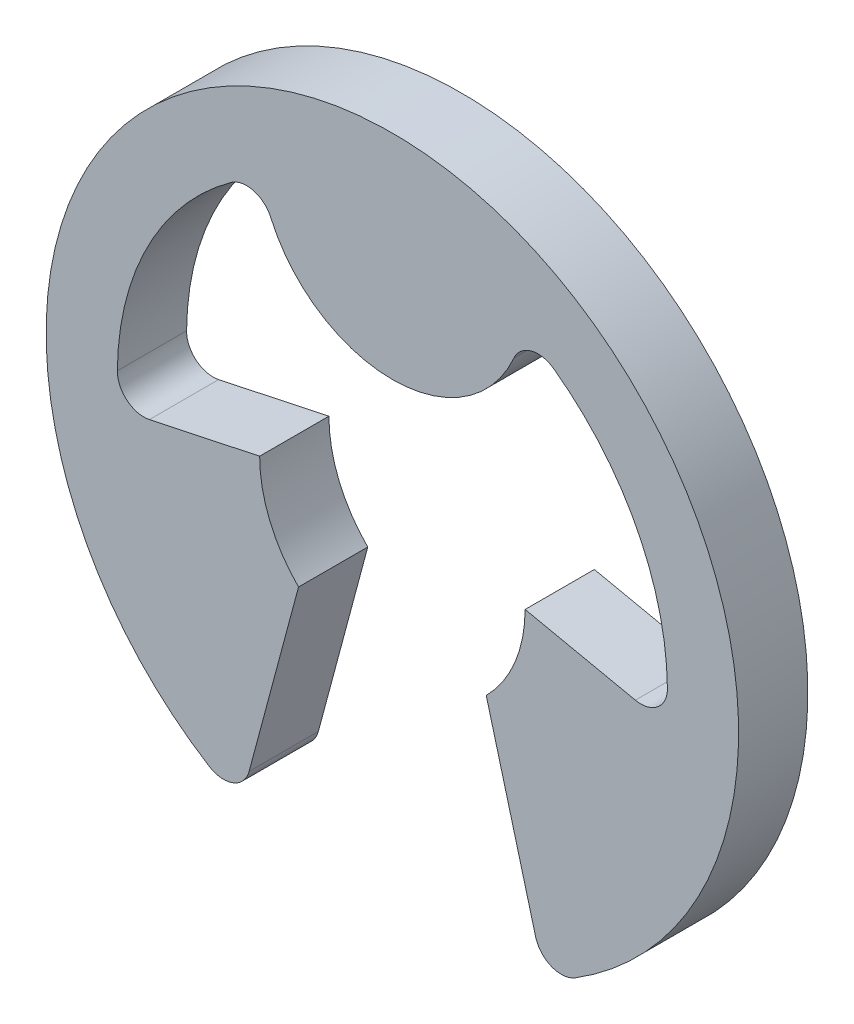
ISO-10303-21;
HEADER;
FILE_DESCRIPTION(('STEP AP214'),'2;1');
FILE_NAME('part.step','',(''),(''),'','','');
FILE_SCHEMA(('AUTOMOTIVE_DESIGN { 1 0 10303 214 1 1 1 1 }'));
ENDSEC;
DATA;
#1=APPLICATION_CONTEXT('core data for automotive mechanical design processes');
#2=APPLICATION_PROTOCOL_DEFINITION('international standard','automotive_design',2000,#1);
#3=PRODUCT_CONTEXT('',#1,'mechanical');
#4=PRODUCT('Part','Part','',(#3));
#5=PRODUCT_RELATED_PRODUCT_CATEGORY('part','',(#4));
#6=PRODUCT_DEFINITION_FORMATION('','',#4);
#7=PRODUCT_DEFINITION_CONTEXT('part definition',#1,'design');
#8=PRODUCT_DEFINITION('design','',#6,#7);
#9=PRODUCT_DEFINITION_SHAPE('','',#8);
#10=(LENGTH_UNIT() NAMED_UNIT(*) SI_UNIT(.MILLI.,.METRE.));
#11=(NAMED_UNIT(*) PLANE_ANGLE_UNIT() SI_UNIT($,.RADIAN.));
#12=(NAMED_UNIT(*) SI_UNIT($,.STERADIAN.) SOLID_ANGLE_UNIT());
#13=UNCERTAINTY_MEASURE_WITH_UNIT(LENGTH_MEASURE(1.E-05),#10,'distance_accuracy_value','');
#14=(GEOMETRIC_REPRESENTATION_CONTEXT(3) GLOBAL_UNCERTAINTY_ASSIGNED_CONTEXT((#13)) GLOBAL_UNIT_ASSIGNED_CONTEXT((#10,
#11,#12)) REPRESENTATION_CONTEXT('',''));
#15=CARTESIAN_POINT('',(0.,0.,0.));
#16=DIRECTION('',(0.,0.,1.));
#17=DIRECTION('',(1.,0.,0.));
#18=AXIS2_PLACEMENT_3D('',#15,#16,#17);
#19=CARTESIAN_POINT('',(0.,2.3,0.6));
#20=DIRECTION('',(0.,0.,-1.));
#21=DIRECTION('',(-1.,0.,0.));
#22=AXIS2_PLACEMENT_3D('',#19,#20,#21);
#23=CYLINDRICAL_SURFACE('',#22,1.15);
#24=CARTESIAN_POINT('',(0.,2.3,0.));
#25=DIRECTION('',(0.,0.,1.));
#26=DIRECTION('',(1.,0.,0.));
#27=AXIS2_PLACEMENT_3D('',#24,#25,#26);
#28=CIRCLE('',#27,1.15);
#29=CARTESIAN_POINT('',(-1.05253488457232,1.83667471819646,0.));
#30=VERTEX_POINT('',#29);
#31=CARTESIAN_POINT('',(1.05253488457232,1.83667471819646,0.));
#32=VERTEX_POINT('',#31);
#33=EDGE_CURVE('E177',#30,#32,#28,.T.);
#34=ORIENTED_EDGE('',*,*,#33,.T.);
#35=DIRECTION('',(0.,0.,-1.));
#36=VECTOR('',#35,1.);
#37=CARTESIAN_POINT('',(1.05253488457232,1.83667471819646,0.6));
#38=LINE('',#37,#36);
#39=CARTESIAN_POINT('',(1.05253488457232,1.83667471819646,0.6));
#40=VERTEX_POINT('',#39);
#41=EDGE_CURVE('E11',#40,#32,#38,.T.);
#42=ORIENTED_EDGE('',*,*,#41,.F.);
#43=CARTESIAN_POINT('',(0.,2.3,0.6));
#44=DIRECTION('',(0.,0.,1.));
#45=DIRECTION('',(1.,0.,0.));
#46=AXIS2_PLACEMENT_3D('',#43,#44,#45);
#47=CIRCLE('',#46,1.15);
#48=CARTESIAN_POINT('',(-1.05253488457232,1.83667471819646,0.6));
#49=VERTEX_POINT('',#48);
#50=EDGE_CURVE('E207',#49,#40,#47,.T.);
#51=ORIENTED_EDGE('',*,*,#50,.F.);
#52=DIRECTION('',(0.,0.,-1.));
#53=VECTOR('',#52,1.);
#54=CARTESIAN_POINT('',(-1.05253488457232,1.83667471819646,0.6));
#55=LINE('',#54,#53);
#56=EDGE_CURVE('E173',#49,#30,#55,.T.);
#57=ORIENTED_EDGE('',*,*,#56,.T.);
#58=EDGE_LOOP('',(#34,#42,#51,#57));
#59=FACE_BOUND('',#58,.T.);
#60=ADVANCED_FACE('F33',(#59),#23,.T.);
#61=CARTESIAN_POINT('',(1.26304186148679,1.74400966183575,0.6));
#62=DIRECTION('',(0.,0.,-1.));
#63=DIRECTION('',(-1.,0.,0.));
#64=AXIS2_PLACEMENT_3D('',#61,#62,#63);
#65=CYLINDRICAL_SURFACE('',#64,0.229999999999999);
#66=CARTESIAN_POINT('',(1.26304186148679,1.74400966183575,0.));
#67=DIRECTION('',(0.,0.,-1.));
#68=DIRECTION('',(-1.,0.,0.));
#69=AXIS2_PLACEMENT_3D('',#66,#67,#68);
#70=CIRCLE('',#69,0.229999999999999);
#71=CARTESIAN_POINT('',(1.39794880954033,1.93028933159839,0.));
#72=VERTEX_POINT('',#71);
#73=EDGE_CURVE('E180',#32,#72,#70,.T.);
#74=ORIENTED_EDGE('',*,*,#73,.T.);
#75=DIRECTION('',(0.,0.,-1.));
#76=VECTOR('',#75,1.);
#77=CARTESIAN_POINT('',(1.39794880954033,1.93028933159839,0.6));
#78=LINE('',#77,#76);
#79=CARTESIAN_POINT('',(1.39794880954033,1.93028933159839,0.6));
#80=VERTEX_POINT('',#79);
#81=EDGE_CURVE('E41',#80,#72,#78,.T.);
#82=ORIENTED_EDGE('',*,*,#81,.F.);
#83=CARTESIAN_POINT('',(1.26304186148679,1.74400966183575,0.6));
#84=DIRECTION('',(0.,0.,-1.));
#85=DIRECTION('',(-1.,0.,0.));
#86=AXIS2_PLACEMENT_3D('',#83,#84,#85);
#87=CIRCLE('',#86,0.229999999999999);
#88=EDGE_CURVE('E116',#40,#80,#87,.T.);
#89=ORIENTED_EDGE('',*,*,#88,.F.);
#90=ORIENTED_EDGE('',*,*,#41,.T.);
#91=EDGE_LOOP('',(#74,#82,#89,#90));
#92=FACE_BOUND('',#91,.T.);
#93=ADVANCED_FACE('F305',(#92),#65,.F.);
#94=CARTESIAN_POINT('',(0.,0.,0.6));
#95=DIRECTION('',(0.,0.,-1.));
#96=DIRECTION('',(-1.,0.,0.));
#97=AXIS2_PLACEMENT_3D('',#94,#95,#96);
#98=CYLINDRICAL_SURFACE('',#97,2.38333333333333);
#99=CARTESIAN_POINT('',(0.,0.,0.));
#100=DIRECTION('',(0.,0.,-1.));
#101=DIRECTION('',(-1.,0.,0.));
#102=AXIS2_PLACEMENT_3D('',#99,#100,#101);
#103=CIRCLE('',#102,2.38333333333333);
#104=CARTESIAN_POINT('',(2.38321010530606,0.0242357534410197,0.));
#105=VERTEX_POINT('',#104);
#106=EDGE_CURVE('E182',#72,#105,#103,.T.);
#107=ORIENTED_EDGE('',*,*,#106,.T.);
#108=DIRECTION('',(0.,0.,-1.));
#109=VECTOR('',#108,1.);
#110=CARTESIAN_POINT('',(2.38321010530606,0.0242357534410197,0.6));
#111=LINE('',#110,#109);
#112=CARTESIAN_POINT('',(2.38321010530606,0.0242357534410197,0.6));
#113=VERTEX_POINT('',#112);
#114=EDGE_CURVE('E238',#113,#105,#111,.T.);
#115=ORIENTED_EDGE('',*,*,#114,.F.);
#116=CARTESIAN_POINT('',(0.,0.,0.6));
#117=DIRECTION('',(0.,0.,-1.));
#118=DIRECTION('',(-1.,0.,0.));
#119=AXIS2_PLACEMENT_3D('',#116,#117,#118);
#120=CIRCLE('',#119,2.38333333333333);
#121=EDGE_CURVE('E246',#80,#113,#120,.T.);
#122=ORIENTED_EDGE('',*,*,#121,.F.);
#123=ORIENTED_EDGE('',*,*,#81,.T.);
#124=EDGE_LOOP('',(#107,#115,#122,#123));
#125=FACE_BOUND('',#124,.T.);
#126=ADVANCED_FACE('F244',(#125),#98,.F.);
#127=CARTESIAN_POINT('',(2.15322199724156,0.0218969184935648,0.6));
#128=DIRECTION('',(0.,0.,-1.));
#129=DIRECTION('',(-1.,0.,0.));
#130=AXIS2_PLACEMENT_3D('',#127,#128,#129);
#131=CYLINDRICAL_SURFACE('',#130,0.229999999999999);
#132=CARTESIAN_POINT('',(2.15322199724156,0.0218969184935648,0.));
#133=DIRECTION('',(0.,0.,-1.));
#134=DIRECTION('',(-1.,0.,0.));
#135=AXIS2_PLACEMENT_3D('',#132,#133,#134);
#136=CIRCLE('',#135,0.229999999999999);
#137=CARTESIAN_POINT('',(2.10540230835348,-0.20307702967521,0.));
#138=VERTEX_POINT('',#137);
#139=EDGE_CURVE('E184',#105,#138,#136,.T.);
#140=ORIENTED_EDGE('',*,*,#139,.T.);
#141=DIRECTION('',(0.,0.,-1.));
#142=VECTOR('',#141,1.);
#143=CARTESIAN_POINT('',(2.10540230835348,-0.20307702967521,0.6));
#144=LINE('',#143,#142);
#145=CARTESIAN_POINT('',(2.10540230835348,-0.20307702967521,0.6));
#146=VERTEX_POINT('',#145);
#147=EDGE_CURVE('E235',#146,#138,#144,.T.);
#148=ORIENTED_EDGE('',*,*,#147,.F.);
#149=CARTESIAN_POINT('',(2.15322199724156,0.0218969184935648,0.6));
#150=DIRECTION('',(0.,0.,-1.));
#151=DIRECTION('',(-1.,0.,0.));
#152=AXIS2_PLACEMENT_3D('',#149,#150,#151);
#153=CIRCLE('',#152,0.229999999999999);
#154=EDGE_CURVE('E264',#113,#146,#153,.T.);
#155=ORIENTED_EDGE('',*,*,#154,.F.);
#156=ORIENTED_EDGE('',*,*,#114,.T.);
#157=EDGE_LOOP('',(#140,#148,#155,#156));
#158=FACE_BOUND('',#157,.T.);
#159=ADVANCED_FACE('F255',(#158),#131,.F.);
#160=CARTESIAN_POINT('',(2.10540230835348,-0.203077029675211,0.6));
#161=DIRECTION('',(-0.207911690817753,-0.978147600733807,0.));
#162=DIRECTION('',(0.978147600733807,-0.207911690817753,0.));
#163=AXIS2_PLACEMENT_3D('',#160,#161,#162);
#164=PLANE('',#163);
#165=DIRECTION('',(-0.978147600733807,0.207911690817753,0.));
#166=VECTOR('',#165,1.);
#167=CARTESIAN_POINT('',(2.10540230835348,-0.203077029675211,0.));
#168=LINE('',#167,#166);
#169=CARTESIAN_POINT('',(1.15,0.,0.));
#170=VERTEX_POINT('',#169);
#171=EDGE_CURVE('E186',#138,#170,#168,.T.);
#172=ORIENTED_EDGE('',*,*,#171,.T.);
#173=DIRECTION('',(0.,0.,-1.));
#174=VECTOR('',#173,1.);
#175=CARTESIAN_POINT('',(1.15,0.,0.6));
#176=LINE('',#175,#174);
#177=CARTESIAN_POINT('',(1.15,0.,0.6));
#178=VERTEX_POINT('',#177);
#179=EDGE_CURVE('E232',#178,#170,#176,.T.);
#180=ORIENTED_EDGE('',*,*,#179,.F.);
#181=DIRECTION('',(-0.978147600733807,0.207911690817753,0.));
#182=VECTOR('',#181,1.);
#183=CARTESIAN_POINT('',(2.10540230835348,-0.203077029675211,0.6));
#184=LINE('',#183,#182);
#185=EDGE_CURVE('E261',#146,#178,#184,.T.);
#186=ORIENTED_EDGE('',*,*,#185,.F.);
#187=ORIENTED_EDGE('',*,*,#147,.T.);
#188=EDGE_LOOP('',(#172,#180,#186,#187));
#189=FACE_BOUND('',#188,.T.);
#190=ADVANCED_FACE('F259',(#189),#164,.F.);
#191=CARTESIAN_POINT('',(0.,0.,0.6));
#192=DIRECTION('',(0.,0.,-1.));
#193=DIRECTION('',(-1.,0.,0.));
#194=AXIS2_PLACEMENT_3D('',#191,#192,#193);
#195=CYLINDRICAL_SURFACE('',#194,1.15);
#196=CARTESIAN_POINT('',(0.,0.,0.));
#197=DIRECTION('',(0.,0.,-1.));
#198=DIRECTION('',(-1.,0.,0.));
#199=AXIS2_PLACEMENT_3D('',#196,#197,#198);
#200=CIRCLE('',#199,1.15);
#201=CARTESIAN_POINT('',(0.813172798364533,-0.813172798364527,0.));
#202=VERTEX_POINT('',#201);
#203=EDGE_CURVE('E188',#170,#202,#200,.T.);
#204=ORIENTED_EDGE('',*,*,#203,.T.);
#205=DIRECTION('',(0.,0.,-1.));
#206=VECTOR('',#205,1.);
#207=CARTESIAN_POINT('',(0.813172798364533,-0.813172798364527,0.6));
#208=LINE('',#207,#206);
#209=CARTESIAN_POINT('',(0.813172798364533,-0.813172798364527,0.6));
#210=VERTEX_POINT('',#209);
#211=EDGE_CURVE('E229',#210,#202,#208,.T.);
#212=ORIENTED_EDGE('',*,*,#211,.F.);
#213=CARTESIAN_POINT('',(0.,0.,0.6));
#214=DIRECTION('',(0.,0.,-1.));
#215=DIRECTION('',(-1.,0.,0.));
#216=AXIS2_PLACEMENT_3D('',#213,#214,#215);
#217=CIRCLE('',#216,1.15);
#218=EDGE_CURVE('E263',#178,#210,#217,.T.);
#219=ORIENTED_EDGE('',*,*,#218,.F.);
#220=ORIENTED_EDGE('',*,*,#179,.T.);
#221=EDGE_LOOP('',(#204,#212,#219,#220));
#222=FACE_BOUND('',#221,.T.);
#223=ADVANCED_FACE('F318',(#222),#195,.F.);
#224=CARTESIAN_POINT('',(0.813172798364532,-0.813172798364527,0.6));
#225=DIRECTION('',(0.965925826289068,0.258819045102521,0.));
#226=DIRECTION('',(-0.258819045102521,0.965925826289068,0.));
#227=AXIS2_PLACEMENT_3D('',#224,#225,#226);
#228=PLANE('',#227);
#229=DIRECTION('',(0.258819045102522,-0.965925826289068,0.));
#230=VECTOR('',#229,1.);
#231=CARTESIAN_POINT('',(0.813172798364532,-0.813172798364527,0.));
#232=LINE('',#231,#230);
#233=CARTESIAN_POINT('',(1.24139379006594,-2.41131529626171,0.));
#234=VERTEX_POINT('',#233);
#235=EDGE_CURVE('E190',#202,#234,#232,.T.);
#236=ORIENTED_EDGE('',*,*,#235,.T.);
#237=DIRECTION('',(0.,0.,-1.));
#238=VECTOR('',#237,1.);
#239=CARTESIAN_POINT('',(1.24139379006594,-2.41131529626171,0.6));
#240=LINE('',#239,#238);
#241=CARTESIAN_POINT('',(1.24139379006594,-2.41131529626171,0.6));
#242=VERTEX_POINT('',#241);
#243=EDGE_CURVE('E226',#242,#234,#240,.T.);
#244=ORIENTED_EDGE('',*,*,#243,.F.);
#245=DIRECTION('',(0.258819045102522,-0.965925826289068,0.));
#246=VECTOR('',#245,1.);
#247=CARTESIAN_POINT('',(0.813172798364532,-0.813172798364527,0.6));
#248=LINE('',#247,#246);
#249=EDGE_CURVE('E266',#210,#242,#248,.T.);
#250=ORIENTED_EDGE('',*,*,#249,.F.);
#251=ORIENTED_EDGE('',*,*,#211,.T.);
#252=EDGE_LOOP('',(#236,#244,#250,#251));
#253=FACE_BOUND('',#252,.T.);
#254=ADVANCED_FACE('F321',(#253),#228,.F.);
#255=CARTESIAN_POINT('',(1.46355673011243,-2.35178691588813,0.6));
#256=DIRECTION('',(0.,0.,-1.));
#257=DIRECTION('',(-1.,0.,0.));
#258=AXIS2_PLACEMENT_3D('',#255,#256,#257);
#259=CYLINDRICAL_SURFACE('',#258,0.23);
#260=CARTESIAN_POINT('',(1.46355673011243,-2.35178691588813,0.));
#261=DIRECTION('',(0.,0.,1.));
#262=DIRECTION('',(-1.,0.,0.));
#263=AXIS2_PLACEMENT_3D('',#260,#261,#262);
#264=CIRCLE('',#263,0.23);
#265=CARTESIAN_POINT('',(1.58507949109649,-2.5470616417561,0.));
#266=VERTEX_POINT('',#265);
#267=EDGE_CURVE('E192',#234,#266,#264,.T.);
#268=ORIENTED_EDGE('',*,*,#267,.T.);
#269=DIRECTION('',(0.,0.,-1.));
#270=VECTOR('',#269,1.);
#271=CARTESIAN_POINT('',(1.58507949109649,-2.5470616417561,0.6));
#272=LINE('',#271,#270);
#273=CARTESIAN_POINT('',(1.58507949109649,-2.5470616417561,0.6));
#274=VERTEX_POINT('',#273);
#275=EDGE_CURVE('E223',#274,#266,#272,.T.);
#276=ORIENTED_EDGE('',*,*,#275,.F.);
#277=CARTESIAN_POINT('',(1.46355673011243,-2.35178691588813,0.6));
#278=DIRECTION('',(0.,0.,1.));
#279=DIRECTION('',(-1.,0.,0.));
#280=AXIS2_PLACEMENT_3D('',#277,#278,#279);
#281=CIRCLE('',#280,0.23);
#282=EDGE_CURVE('E272',#242,#274,#281,.T.);
#283=ORIENTED_EDGE('',*,*,#282,.F.);
#284=ORIENTED_EDGE('',*,*,#243,.T.);
#285=EDGE_LOOP('',(#268,#276,#283,#284));
#286=FACE_BOUND('',#285,.T.);
#287=ADVANCED_FACE('F325',(#286),#259,.T.);
#288=CARTESIAN_POINT('',(0.,0.,0.6));
#289=DIRECTION('',(0.,0.,-1.));
#290=DIRECTION('',(-1.,0.,0.));
#291=AXIS2_PLACEMENT_3D('',#288,#289,#290);
#292=CYLINDRICAL_SURFACE('',#291,3.);
#293=CARTESIAN_POINT('',(0.,0.,0.));
#294=DIRECTION('',(0.,0.,1.));
#295=DIRECTION('',(1.,0.,0.));
#296=AXIS2_PLACEMENT_3D('',#293,#294,#295);
#297=CIRCLE('',#296,3.);
#298=CARTESIAN_POINT('',(-1.58507949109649,-2.5470616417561,0.));
#299=VERTEX_POINT('',#298);
#300=EDGE_CURVE('E194',#266,#299,#297,.T.);
#301=ORIENTED_EDGE('',*,*,#300,.T.);
#302=DIRECTION('',(0.,0.,-1.));
#303=VECTOR('',#302,1.);
#304=CARTESIAN_POINT('',(-1.58507949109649,-2.5470616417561,0.6));
#305=LINE('',#304,#303);
#306=CARTESIAN_POINT('',(-1.58507949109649,-2.5470616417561,0.6));
#307=VERTEX_POINT('',#306);
#308=EDGE_CURVE('E220',#307,#299,#305,.T.);
#309=ORIENTED_EDGE('',*,*,#308,.F.);
#310=CARTESIAN_POINT('',(0.,0.,0.6));
#311=DIRECTION('',(0.,0.,1.));
#312=DIRECTION('',(1.,0.,0.));
#313=AXIS2_PLACEMENT_3D('',#310,#311,#312);
#314=CIRCLE('',#313,3.);
#315=EDGE_CURVE('E274',#274,#307,#314,.T.);
#316=ORIENTED_EDGE('',*,*,#315,.F.);
#317=ORIENTED_EDGE('',*,*,#275,.T.);
#318=EDGE_LOOP('',(#301,#309,#316,#317));
#319=FACE_BOUND('',#318,.T.);
#320=ADVANCED_FACE('F329',(#319),#292,.T.);
#321=CARTESIAN_POINT('',(-1.46355673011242,-2.35178691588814,0.6));
#322=DIRECTION('',(0.,0.,-1.));
#323=DIRECTION('',(-1.,0.,0.));
#324=AXIS2_PLACEMENT_3D('',#321,#322,#323);
#325=CYLINDRICAL_SURFACE('',#324,0.23);
#326=CARTESIAN_POINT('',(-1.46355673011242,-2.35178691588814,0.));
#327=DIRECTION('',(0.,0.,1.));
#328=DIRECTION('',(1.,0.,0.));
#329=AXIS2_PLACEMENT_3D('',#326,#327,#328);
#330=CIRCLE('',#329,0.23);
#331=CARTESIAN_POINT('',(-1.24139379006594,-2.41131529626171,0.));
#332=VERTEX_POINT('',#331);
#333=EDGE_CURVE('E196',#299,#332,#330,.T.);
#334=ORIENTED_EDGE('',*,*,#333,.T.);
#335=DIRECTION('',(0.,0.,-1.));
#336=VECTOR('',#335,1.);
#337=CARTESIAN_POINT('',(-1.24139379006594,-2.41131529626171,0.6));
#338=LINE('',#337,#336);
#339=CARTESIAN_POINT('',(-1.24139379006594,-2.41131529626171,0.6));
#340=VERTEX_POINT('',#339);
#341=EDGE_CURVE('E217',#340,#332,#338,.T.);
#342=ORIENTED_EDGE('',*,*,#341,.F.);
#343=CARTESIAN_POINT('',(-1.46355673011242,-2.35178691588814,0.6));
#344=DIRECTION('',(0.,0.,1.));
#345=DIRECTION('',(1.,0.,0.));
#346=AXIS2_PLACEMENT_3D('',#343,#344,#345);
#347=CIRCLE('',#346,0.23);
#348=EDGE_CURVE('E276',#307,#340,#347,.T.);
#349=ORIENTED_EDGE('',*,*,#348,.F.);
#350=ORIENTED_EDGE('',*,*,#308,.T.);
#351=EDGE_LOOP('',(#334,#342,#349,#350));
#352=FACE_BOUND('',#351,.T.);
#353=ADVANCED_FACE('F333',(#352),#325,.T.);
#354=CARTESIAN_POINT('',(-0.81317279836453,-0.813172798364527,0.6));
#355=DIRECTION('',(-0.965925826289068,0.258819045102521,0.));
#356=DIRECTION('',(-0.258819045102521,-0.965925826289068,0.));
#357=AXIS2_PLACEMENT_3D('',#354,#355,#356);
#358=PLANE('',#357);
#359=DIRECTION('',(0.258819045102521,0.965925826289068,0.));
#360=VECTOR('',#359,1.);
#361=CARTESIAN_POINT('',(-0.81317279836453,-0.813172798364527,0.));
#362=LINE('',#361,#360);
#363=CARTESIAN_POINT('',(-0.81317279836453,-0.813172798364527,0.));
#364=VERTEX_POINT('',#363);
#365=EDGE_CURVE('E198',#332,#364,#362,.T.);
#366=ORIENTED_EDGE('',*,*,#365,.T.);
#367=DIRECTION('',(0.,0.,-1.));
#368=VECTOR('',#367,1.);
#369=CARTESIAN_POINT('',(-0.81317279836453,-0.813172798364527,0.6));
#370=LINE('',#369,#368);
#371=CARTESIAN_POINT('',(-0.81317279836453,-0.813172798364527,0.6));
#372=VERTEX_POINT('',#371);
#373=EDGE_CURVE('E214',#372,#364,#370,.T.);
#374=ORIENTED_EDGE('',*,*,#373,.F.);
#375=DIRECTION('',(0.258819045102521,0.965925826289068,0.));
#376=VECTOR('',#375,1.);
#377=CARTESIAN_POINT('',(-0.81317279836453,-0.813172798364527,0.6));
#378=LINE('',#377,#376);
#379=EDGE_CURVE('E278',#340,#372,#378,.T.);
#380=ORIENTED_EDGE('',*,*,#379,.F.);
#381=ORIENTED_EDGE('',*,*,#341,.T.);
#382=EDGE_LOOP('',(#366,#374,#380,#381));
#383=FACE_BOUND('',#382,.T.);
#384=ADVANCED_FACE('F337',(#383),#358,.F.);
#385=CARTESIAN_POINT('',(0.,0.,0.6));
#386=DIRECTION('',(0.,0.,-1.));
#387=DIRECTION('',(-1.,0.,0.));
#388=AXIS2_PLACEMENT_3D('',#385,#386,#387);
#389=CYLINDRICAL_SURFACE('',#388,1.15);
#390=CARTESIAN_POINT('',(0.,0.,0.));
#391=DIRECTION('',(0.,0.,-1.));
#392=DIRECTION('',(1.,0.,0.));
#393=AXIS2_PLACEMENT_3D('',#390,#391,#392);
#394=CIRCLE('',#393,1.15);
#395=CARTESIAN_POINT('',(-1.15,0.,0.));
#396=VERTEX_POINT('',#395);
#397=EDGE_CURVE('E200',#364,#396,#394,.T.);
#398=ORIENTED_EDGE('',*,*,#397,.T.);
#399=DIRECTION('',(0.,0.,-1.));
#400=VECTOR('',#399,1.);
#401=CARTESIAN_POINT('',(-1.15,0.,0.6));
#402=LINE('',#401,#400);
#403=CARTESIAN_POINT('',(-1.15,0.,0.6));
#404=VERTEX_POINT('',#403);
#405=EDGE_CURVE('E211',#404,#396,#402,.T.);
#406=ORIENTED_EDGE('',*,*,#405,.F.);
#407=CARTESIAN_POINT('',(0.,0.,0.6));
#408=DIRECTION('',(0.,0.,-1.));
#409=DIRECTION('',(1.,0.,0.));
#410=AXIS2_PLACEMENT_3D('',#407,#408,#409);
#411=CIRCLE('',#410,1.15);
#412=EDGE_CURVE('E280',#372,#404,#411,.T.);
#413=ORIENTED_EDGE('',*,*,#412,.F.);
#414=ORIENTED_EDGE('',*,*,#373,.T.);
#415=EDGE_LOOP('',(#398,#406,#413,#414));
#416=FACE_BOUND('',#415,.T.);
#417=ADVANCED_FACE('F286',(#416),#389,.F.);
#418=CARTESIAN_POINT('',(-2.10540230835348,-0.203077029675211,0.6));
#419=DIRECTION('',(0.207911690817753,-0.978147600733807,0.));
#420=DIRECTION('',(0.978147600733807,0.207911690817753,0.));
#421=AXIS2_PLACEMENT_3D('',#418,#419,#420);
#422=PLANE('',#421);
#423=DIRECTION('',(-0.978147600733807,-0.207911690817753,0.));
#424=VECTOR('',#423,1.);
#425=CARTESIAN_POINT('',(-2.10540230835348,-0.203077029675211,0.));
#426=LINE('',#425,#424);
#427=CARTESIAN_POINT('',(-2.10540230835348,-0.203077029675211,0.));
#428=VERTEX_POINT('',#427);
#429=EDGE_CURVE('E202',#396,#428,#426,.T.);
#430=ORIENTED_EDGE('',*,*,#429,.T.);
#431=DIRECTION('',(0.,0.,-1.));
#432=VECTOR('',#431,1.);
#433=CARTESIAN_POINT('',(-2.10540230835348,-0.203077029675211,0.6));
#434=LINE('',#433,#432);
#435=CARTESIAN_POINT('',(-2.10540230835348,-0.203077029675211,0.6));
#436=VERTEX_POINT('',#435);
#437=EDGE_CURVE('E168',#436,#428,#434,.T.);
#438=ORIENTED_EDGE('',*,*,#437,.F.);
#439=DIRECTION('',(-0.978147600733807,-0.207911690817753,0.));
#440=VECTOR('',#439,1.);
#441=CARTESIAN_POINT('',(-2.10540230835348,-0.203077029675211,0.6));
#442=LINE('',#441,#440);
#443=EDGE_CURVE('E159',#404,#436,#442,.T.);
#444=ORIENTED_EDGE('',*,*,#443,.F.);
#445=ORIENTED_EDGE('',*,*,#405,.T.);
#446=EDGE_LOOP('',(#430,#438,#444,#445));
#447=FACE_BOUND('',#446,.T.);
#448=ADVANCED_FACE('F290',(#447),#422,.F.);
#449=CARTESIAN_POINT('',(-2.15322199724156,0.0218969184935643,0.6));
#450=DIRECTION('',(0.,0.,-1.));
#451=DIRECTION('',(-1.,0.,0.));
#452=AXIS2_PLACEMENT_3D('',#449,#450,#451);
#453=CYLINDRICAL_SURFACE('',#452,0.229999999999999);
#454=CARTESIAN_POINT('',(-2.15322199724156,0.0218969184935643,0.));
#455=DIRECTION('',(0.,0.,-1.));
#456=DIRECTION('',(1.,0.,0.));
#457=AXIS2_PLACEMENT_3D('',#454,#455,#456);
#458=CIRCLE('',#457,0.229999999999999);
#459=CARTESIAN_POINT('',(-2.38321010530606,0.0242357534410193,0.));
#460=VERTEX_POINT('',#459);
#461=EDGE_CURVE('E167',#428,#460,#458,.T.);
#462=ORIENTED_EDGE('',*,*,#461,.T.);
#463=DIRECTION('',(0.,0.,-1.));
#464=VECTOR('',#463,1.);
#465=CARTESIAN_POINT('',(-2.38321010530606,0.0242357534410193,0.6));
#466=LINE('',#465,#464);
#467=CARTESIAN_POINT('',(-2.38321010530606,0.0242357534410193,0.6));
#468=VERTEX_POINT('',#467);
#469=EDGE_CURVE('E164',#468,#460,#466,.T.);
#470=ORIENTED_EDGE('',*,*,#469,.F.);
#471=CARTESIAN_POINT('',(-2.15322199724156,0.0218969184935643,0.6));
#472=DIRECTION('',(0.,0.,-1.));
#473=DIRECTION('',(1.,0.,0.));
#474=AXIS2_PLACEMENT_3D('',#471,#472,#473);
#475=CIRCLE('',#474,0.229999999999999);
#476=EDGE_CURVE('E153',#436,#468,#475,.T.);
#477=ORIENTED_EDGE('',*,*,#476,.F.);
#478=ORIENTED_EDGE('',*,*,#437,.T.);
#479=EDGE_LOOP('',(#462,#470,#477,#478));
#480=FACE_BOUND('',#479,.T.);
#481=ADVANCED_FACE('F165',(#480),#453,.F.);
#482=CARTESIAN_POINT('',(0.,0.,0.6));
#483=DIRECTION('',(0.,0.,-1.));
#484=DIRECTION('',(-1.,0.,0.));
#485=AXIS2_PLACEMENT_3D('',#482,#483,#484);
#486=CYLINDRICAL_SURFACE('',#485,2.38333333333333);
#487=CARTESIAN_POINT('',(0.,0.,0.));
#488=DIRECTION('',(0.,0.,-1.));
#489=DIRECTION('',(1.,0.,0.));
#490=AXIS2_PLACEMENT_3D('',#487,#488,#489);
#491=CIRCLE('',#490,2.38333333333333);
#492=CARTESIAN_POINT('',(-1.39794880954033,1.93028933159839,0.));
#493=VERTEX_POINT('',#492);
#494=EDGE_CURVE('E102',#460,#493,#491,.T.);
#495=ORIENTED_EDGE('',*,*,#494,.T.);
#496=DIRECTION('',(0.,0.,-1.));
#497=VECTOR('',#496,1.);
#498=CARTESIAN_POINT('',(-1.39794880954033,1.93028933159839,0.6));
#499=LINE('',#498,#497);
#500=CARTESIAN_POINT('',(-1.39794880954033,1.93028933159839,0.6));
#501=VERTEX_POINT('',#500);
#502=EDGE_CURVE('E169',#501,#493,#499,.T.);
#503=ORIENTED_EDGE('',*,*,#502,.F.);
#504=CARTESIAN_POINT('',(0.,0.,0.6));
#505=DIRECTION('',(0.,0.,-1.));
#506=DIRECTION('',(1.,0.,0.));
#507=AXIS2_PLACEMENT_3D('',#504,#505,#506);
#508=CIRCLE('',#507,2.38333333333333);
#509=EDGE_CURVE('E157',#468,#501,#508,.T.);
#510=ORIENTED_EDGE('',*,*,#509,.F.);
#511=ORIENTED_EDGE('',*,*,#469,.T.);
#512=EDGE_LOOP('',(#495,#503,#510,#511));
#513=FACE_BOUND('',#512,.T.);
#514=ADVANCED_FACE('F171',(#513),#486,.F.);
#515=CARTESIAN_POINT('',(-1.26304186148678,1.74400966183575,0.6));
#516=DIRECTION('',(0.,0.,-1.));
#517=DIRECTION('',(-1.,0.,0.));
#518=AXIS2_PLACEMENT_3D('',#515,#516,#517);
#519=CYLINDRICAL_SURFACE('',#518,0.229999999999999);
#520=CARTESIAN_POINT('',(-1.26304186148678,1.74400966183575,0.));
#521=DIRECTION('',(0.,0.,-1.));
#522=DIRECTION('',(1.,0.,0.));
#523=AXIS2_PLACEMENT_3D('',#520,#521,#522);
#524=CIRCLE('',#523,0.229999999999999);
#525=EDGE_CURVE('E108',#493,#30,#524,.T.);
#526=ORIENTED_EDGE('',*,*,#525,.T.);
#527=ORIENTED_EDGE('',*,*,#56,.F.);
#528=CARTESIAN_POINT('',(-1.26304186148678,1.74400966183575,0.6));
#529=DIRECTION('',(0.,0.,-1.));
#530=DIRECTION('',(1.,0.,0.));
#531=AXIS2_PLACEMENT_3D('',#528,#529,#530);
#532=CIRCLE('',#531,0.229999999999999);
#533=EDGE_CURVE('E49',#501,#49,#532,.T.);
#534=ORIENTED_EDGE('',*,*,#533,.F.);
#535=ORIENTED_EDGE('',*,*,#502,.T.);
#536=EDGE_LOOP('',(#526,#527,#534,#535));
#537=FACE_BOUND('',#536,.T.);
#538=ADVANCED_FACE('F294',(#537),#519,.F.);
#539=CARTESIAN_POINT('',(0.,2.3,0.6));
#540=DIRECTION('',(0.,0.,1.));
#541=DIRECTION('',(1.,0.,0.));
#542=AXIS2_PLACEMENT_3D('',#539,#540,#541);
#543=PLANE('',#542);
#544=ORIENTED_EDGE('',*,*,#50,.T.);
#545=ORIENTED_EDGE('',*,*,#88,.T.);
#546=ORIENTED_EDGE('',*,*,#121,.T.);
#547=ORIENTED_EDGE('',*,*,#154,.T.);
#548=ORIENTED_EDGE('',*,*,#185,.T.);
#549=ORIENTED_EDGE('',*,*,#218,.T.);
#550=ORIENTED_EDGE('',*,*,#249,.T.);
#551=ORIENTED_EDGE('',*,*,#282,.T.);
#552=ORIENTED_EDGE('',*,*,#315,.T.);
#553=ORIENTED_EDGE('',*,*,#348,.T.);
#554=ORIENTED_EDGE('',*,*,#379,.T.);
#555=ORIENTED_EDGE('',*,*,#412,.T.);
#556=ORIENTED_EDGE('',*,*,#443,.T.);
#557=ORIENTED_EDGE('',*,*,#476,.T.);
#558=ORIENTED_EDGE('',*,*,#509,.T.);
#559=ORIENTED_EDGE('',*,*,#533,.T.);
#560=EDGE_LOOP('',(#544,#545,#546,#547,#548,#549,#550,#551,#552,#553,#554,#555,#556,#557,#558,#559));
#561=FACE_BOUND('',#560,.T.);
#562=ADVANCED_FACE('F155',(#561),#543,.T.);
#563=CARTESIAN_POINT('',(0.,2.3,0.));
#564=DIRECTION('',(0.,0.,1.));
#565=DIRECTION('',(1.,0.,0.));
#566=AXIS2_PLACEMENT_3D('',#563,#564,#565);
#567=PLANE('',#566);
#568=ORIENTED_EDGE('',*,*,#33,.F.);
#569=ORIENTED_EDGE('',*,*,#525,.F.);
#570=ORIENTED_EDGE('',*,*,#494,.F.);
#571=ORIENTED_EDGE('',*,*,#461,.F.);
#572=ORIENTED_EDGE('',*,*,#429,.F.);
#573=ORIENTED_EDGE('',*,*,#397,.F.);
#574=ORIENTED_EDGE('',*,*,#365,.F.);
#575=ORIENTED_EDGE('',*,*,#333,.F.);
#576=ORIENTED_EDGE('',*,*,#300,.F.);
#577=ORIENTED_EDGE('',*,*,#267,.F.);
#578=ORIENTED_EDGE('',*,*,#235,.F.);
#579=ORIENTED_EDGE('',*,*,#203,.F.);
#580=ORIENTED_EDGE('',*,*,#171,.F.);
#581=ORIENTED_EDGE('',*,*,#139,.F.);
#582=ORIENTED_EDGE('',*,*,#106,.F.);
#583=ORIENTED_EDGE('',*,*,#73,.F.);
#584=EDGE_LOOP('',(#568,#569,#570,#571,#572,#573,#574,#575,#576,#577,#578,#579,#580,#581,#582,#583));
#585=FACE_BOUND('',#584,.T.);
#586=ADVANCED_FACE('F250',(#585),#567,.F.);
#587=CLOSED_SHELL('',(#60,#93,#126,#159,#190,#223,#254,#287,#320,#353,#384,#417,#448,#481,#514,
#538,#562,#586));
#588=MANIFOLD_SOLID_BREP('B2',#587);
#589=ADVANCED_BREP_SHAPE_REPRESENTATION('',(#18,#588),#14);
#590=SHAPE_DEFINITION_REPRESENTATION(#9,#589);
ENDSEC;
END-ISO-10303-21;
